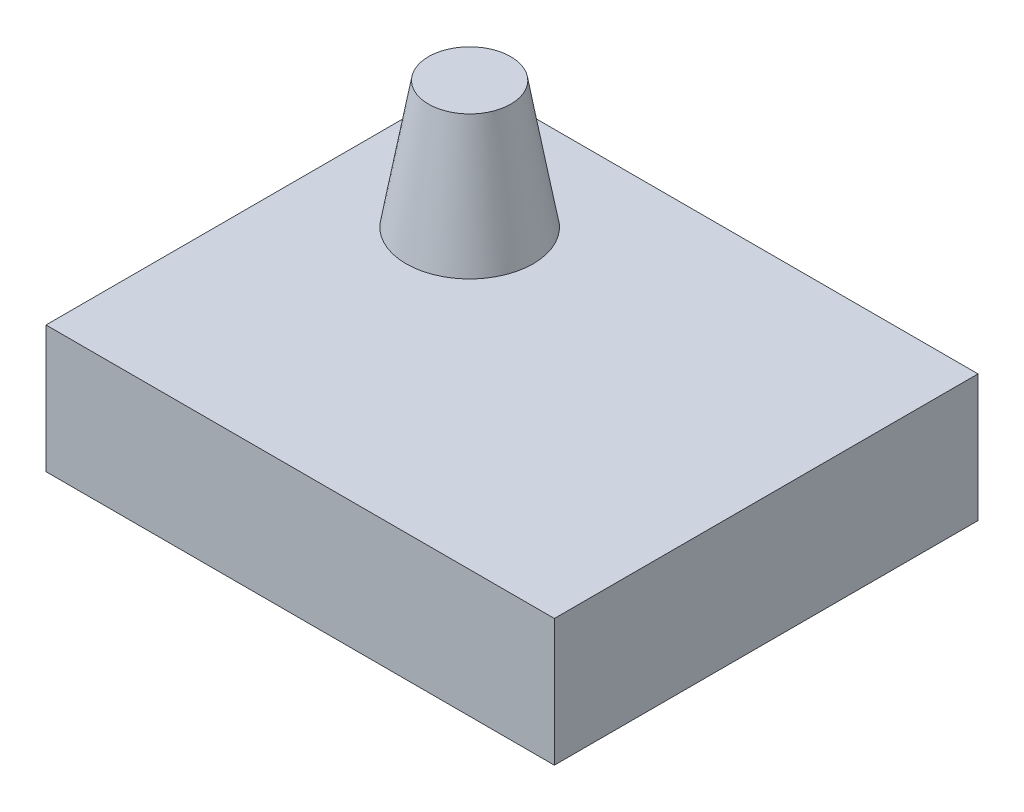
from build123d import *

# Parameters (mm, degrees)
BASE_RECTANDULO_W             = 120
BASE_RECTANDULO_H             = 100
EXTRUSI_NPRISMAINFERIOR_DEPTH = 30
BASE_TRONCO_CONO_R            = 15
EXTRUSI_N_TRONCO_CONO_DEPTH   = 30
EXTRUSI_N_TRONCO_CONO_TAPER   = 10


with BuildPart() as part:
    # Base_rectandulo → Extrusi_nPrismaInferior (new body)
    with BuildSketch(Plane(origin=(0, 0, 0), x_dir=(1, 0, 0), z_dir=(0, 1, 0))):
        Rectangle(BASE_RECTANDULO_W, BASE_RECTANDULO_H)
    extrude(amount=EXTRUSI_NPRISMAINFERIOR_DEPTH)

    # Base_tronco_cono → Extrusi_n_tronco_cono (add)
    with BuildSketch(Plane(origin=(0, 30, 0), x_dir=(1, 0, 0), z_dir=(0, 1, 0))):
        with Locations((-30, 20)):
            Circle(BASE_TRONCO_CONO_R)
    extrude(amount=EXTRUSI_N_TRONCO_CONO_DEPTH, taper=EXTRUSI_N_TRONCO_CONO_TAPER)


solid = part.part
